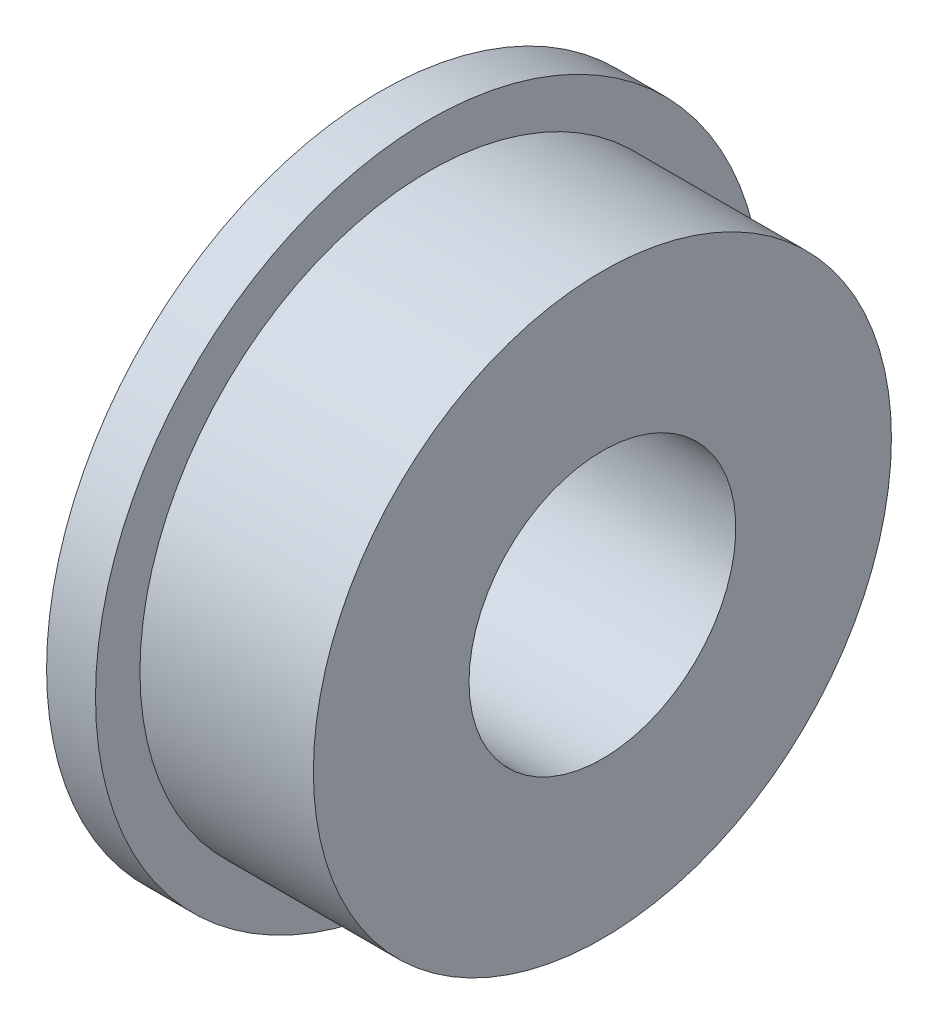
from build123d import *


with BuildPart() as part:
    # Esquisse1 → R_volution1 (revolve)
    with BuildSketch(Plane(origin=(0, 0, 0), x_dir=(1, 0, 0), z_dir=(0, 1, 0)), mode=Mode.PRIVATE) as r_volution1_sk:
        Polygon((0, 3), (0, 7.5), (1.1, 7.5), (1.1, 6.5), (5, 6.5), (5, 3), align=None)
    revolve(r_volution1_sk.sketch.rotate(Axis((0, 0, 0), (1, 0, 0)), 180), axis=Axis((0, 0, 0), (1, 0, 0)))


solid = part.part
